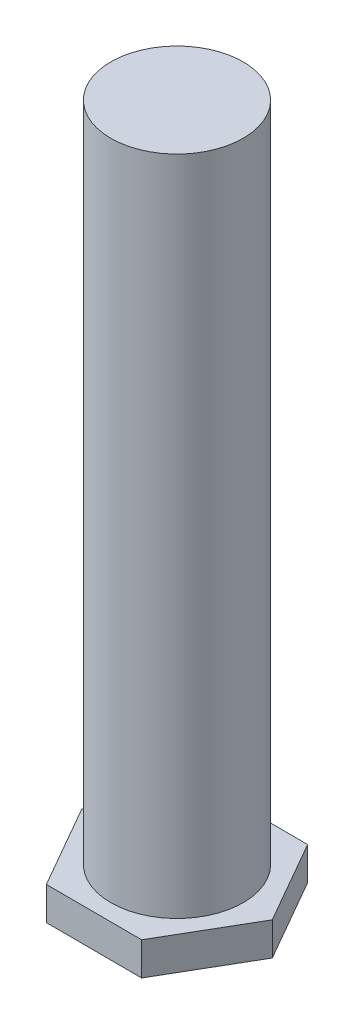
ISO-10303-21;
HEADER;
FILE_DESCRIPTION(('STEP AP214'),'2;1');
FILE_NAME('part.step','',(''),(''),'','','');
FILE_SCHEMA(('AUTOMOTIVE_DESIGN { 1 0 10303 214 1 1 1 1 }'));
ENDSEC;
DATA;
#1=APPLICATION_CONTEXT('core data for automotive mechanical design processes');
#2=APPLICATION_PROTOCOL_DEFINITION('international standard','automotive_design',2000,#1);
#3=PRODUCT_CONTEXT('',#1,'mechanical');
#4=PRODUCT('Part','Part','',(#3));
#5=PRODUCT_RELATED_PRODUCT_CATEGORY('part','',(#4));
#6=PRODUCT_DEFINITION_FORMATION('','',#4);
#7=PRODUCT_DEFINITION_CONTEXT('part definition',#1,'design');
#8=PRODUCT_DEFINITION('design','',#6,#7);
#9=PRODUCT_DEFINITION_SHAPE('','',#8);
#10=(LENGTH_UNIT() NAMED_UNIT(*) SI_UNIT(.MILLI.,.METRE.));
#11=(NAMED_UNIT(*) PLANE_ANGLE_UNIT() SI_UNIT($,.RADIAN.));
#12=(NAMED_UNIT(*) SI_UNIT($,.STERADIAN.) SOLID_ANGLE_UNIT());
#13=UNCERTAINTY_MEASURE_WITH_UNIT(LENGTH_MEASURE(1.E-05),#10,'distance_accuracy_value','');
#14=(GEOMETRIC_REPRESENTATION_CONTEXT(3) GLOBAL_UNCERTAINTY_ASSIGNED_CONTEXT((#13)) GLOBAL_UNIT_ASSIGNED_CONTEXT((#10,
#11,#12)) REPRESENTATION_CONTEXT('',''));
#15=CARTESIAN_POINT('',(0.,0.,0.));
#16=DIRECTION('',(0.,0.,1.));
#17=DIRECTION('',(1.,0.,0.));
#18=AXIS2_PLACEMENT_3D('',#15,#16,#17);
#19=CARTESIAN_POINT('',(-2.90214691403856,2.,4.99107970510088));
#20=DIRECTION('',(0.00308185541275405,0.,-0.999995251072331));
#21=DIRECTION('',(-0.999995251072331,0.,-0.00308185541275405));
#22=AXIS2_PLACEMENT_3D('',#19,#20,#21);
#23=PLANE('',#22);
#24=DIRECTION('',(0.999995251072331,0.,0.00308185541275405));
#25=VECTOR('',#24,1.);
#26=CARTESIAN_POINT('',(-2.90214691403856,0.,4.99107970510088));
#27=LINE('',#26,#25);
#28=CARTESIAN_POINT('',(-2.90214691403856,0.,4.99107970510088));
#29=VERTEX_POINT('',#28);
#30=CARTESIAN_POINT('',(2.87132835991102,0.,5.00887280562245));
#31=VERTEX_POINT('',#30);
#32=EDGE_CURVE('E119',#29,#31,#27,.T.);
#33=ORIENTED_EDGE('',*,*,#32,.T.);
#34=DIRECTION('',(0.,-1.,0.));
#35=VECTOR('',#34,1.);
#36=CARTESIAN_POINT('',(2.87132835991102,2.,5.00887280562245));
#37=LINE('',#36,#35);
#38=CARTESIAN_POINT('',(2.87132835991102,2.,5.00887280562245));
#39=VERTEX_POINT('',#38);
#40=EDGE_CURVE('E36',#39,#31,#37,.T.);
#41=ORIENTED_EDGE('',*,*,#40,.F.);
#42=DIRECTION('',(0.999995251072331,0.,0.00308185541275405));
#43=VECTOR('',#42,1.);
#44=CARTESIAN_POINT('',(-2.90214691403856,2.,4.99107970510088));
#45=LINE('',#44,#43);
#46=CARTESIAN_POINT('',(-2.90214691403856,2.,4.99107970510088));
#47=VERTEX_POINT('',#46);
#48=EDGE_CURVE('E130',#47,#39,#45,.T.);
#49=ORIENTED_EDGE('',*,*,#48,.F.);
#50=DIRECTION('',(0.,-1.,0.));
#51=VECTOR('',#50,1.);
#52=CARTESIAN_POINT('',(-2.90214691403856,2.,4.99107970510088));
#53=LINE('',#52,#51);
#54=EDGE_CURVE('E115',#47,#29,#53,.T.);
#55=ORIENTED_EDGE('',*,*,#54,.T.);
#56=EDGE_LOOP('',(#33,#41,#49,#55));
#57=FACE_BOUND('',#56,.T.);
#58=ADVANCED_FACE('F33',(#57),#23,.F.);
#59=CARTESIAN_POINT('',(2.87132835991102,2.,5.00887280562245));
#60=DIRECTION('',(-0.86448036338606,0.,-0.502666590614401));
#61=DIRECTION('',(-0.502666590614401,0.,0.86448036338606));
#62=AXIS2_PLACEMENT_3D('',#59,#60,#61);
#63=PLANE('',#62);
#64=DIRECTION('',(0.502666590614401,0.,-0.86448036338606));
#65=VECTOR('',#64,1.);
#66=CARTESIAN_POINT('',(2.87132835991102,0.,5.00887280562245));
#67=LINE('',#66,#65);
#68=CARTESIAN_POINT('',(5.77347527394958,0.,0.0177931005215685));
#69=VERTEX_POINT('',#68);
#70=EDGE_CURVE('E122',#31,#69,#67,.T.);
#71=ORIENTED_EDGE('',*,*,#70,.T.);
#72=DIRECTION('',(0.,-1.,0.));
#73=VECTOR('',#72,1.);
#74=CARTESIAN_POINT('',(5.77347527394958,2.,0.0177931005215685));
#75=LINE('',#74,#73);
#76=CARTESIAN_POINT('',(5.77347527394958,2.,0.0177931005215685));
#77=VERTEX_POINT('',#76);
#78=EDGE_CURVE('E133',#77,#69,#75,.T.);
#79=ORIENTED_EDGE('',*,*,#78,.F.);
#80=DIRECTION('',(0.502666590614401,0.,-0.86448036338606));
#81=VECTOR('',#80,1.);
#82=CARTESIAN_POINT('',(2.87132835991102,2.,5.00887280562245));
#83=LINE('',#82,#81);
#84=EDGE_CURVE('E88',#39,#77,#83,.T.);
#85=ORIENTED_EDGE('',*,*,#84,.F.);
#86=ORIENTED_EDGE('',*,*,#40,.T.);
#87=EDGE_LOOP('',(#71,#79,#85,#86));
#88=FACE_BOUND('',#87,.T.);
#89=ADVANCED_FACE('F138',(#88),#63,.F.);
#90=CARTESIAN_POINT('',(5.77347527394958,2.,0.0177931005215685));
#91=DIRECTION('',(-0.867562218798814,0.,0.49732866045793));
#92=DIRECTION('',(0.49732866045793,0.,0.867562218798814));
#93=AXIS2_PLACEMENT_3D('',#90,#91,#92);
#94=PLANE('',#93);
#95=DIRECTION('',(-0.49732866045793,0.,-0.867562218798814));
#96=VECTOR('',#95,1.);
#97=CARTESIAN_POINT('',(5.77347527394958,0.,0.0177931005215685));
#98=LINE('',#97,#96);
#99=CARTESIAN_POINT('',(2.90214691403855,0.,-4.9910797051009));
#100=VERTEX_POINT('',#99);
#101=EDGE_CURVE('E125',#69,#100,#98,.T.);
#102=ORIENTED_EDGE('',*,*,#101,.T.);
#103=DIRECTION('',(0.,-1.,0.));
#104=VECTOR('',#103,1.);
#105=CARTESIAN_POINT('',(2.90214691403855,2.,-4.9910797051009));
#106=LINE('',#105,#104);
#107=CARTESIAN_POINT('',(2.90214691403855,2.,-4.9910797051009));
#108=VERTEX_POINT('',#107);
#109=EDGE_CURVE('E110',#108,#100,#106,.T.);
#110=ORIENTED_EDGE('',*,*,#109,.F.);
#111=DIRECTION('',(-0.49732866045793,0.,-0.867562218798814));
#112=VECTOR('',#111,1.);
#113=CARTESIAN_POINT('',(5.77347527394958,2.,0.0177931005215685));
#114=LINE('',#113,#112);
#115=EDGE_CURVE('E101',#77,#108,#114,.T.);
#116=ORIENTED_EDGE('',*,*,#115,.F.);
#117=ORIENTED_EDGE('',*,*,#78,.T.);
#118=EDGE_LOOP('',(#102,#110,#116,#117));
#119=FACE_BOUND('',#118,.T.);
#120=ADVANCED_FACE('F144',(#119),#94,.F.);
#121=CARTESIAN_POINT('',(2.90214691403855,2.,-4.9910797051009));
#122=DIRECTION('',(-0.00308185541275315,0.,0.999995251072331));
#123=DIRECTION('',(0.999995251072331,0.,0.00308185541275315));
#124=AXIS2_PLACEMENT_3D('',#121,#122,#123);
#125=PLANE('',#124);
#126=DIRECTION('',(-0.999995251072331,0.,-0.00308185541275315));
#127=VECTOR('',#126,1.);
#128=CARTESIAN_POINT('',(2.90214691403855,0.,-4.9910797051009));
#129=LINE('',#128,#127);
#130=CARTESIAN_POINT('',(-2.87132835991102,0.,-5.00887280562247));
#131=VERTEX_POINT('',#130);
#132=EDGE_CURVE('E109',#100,#131,#129,.T.);
#133=ORIENTED_EDGE('',*,*,#132,.T.);
#134=DIRECTION('',(0.,-1.,0.));
#135=VECTOR('',#134,1.);
#136=CARTESIAN_POINT('',(-2.87132835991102,2.,-5.00887280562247));
#137=LINE('',#136,#135);
#138=CARTESIAN_POINT('',(-2.87132835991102,2.,-5.00887280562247));
#139=VERTEX_POINT('',#138);
#140=EDGE_CURVE('E106',#139,#131,#137,.T.);
#141=ORIENTED_EDGE('',*,*,#140,.F.);
#142=DIRECTION('',(-0.999995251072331,0.,-0.00308185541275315));
#143=VECTOR('',#142,1.);
#144=CARTESIAN_POINT('',(2.90214691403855,2.,-4.9910797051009));
#145=LINE('',#144,#143);
#146=EDGE_CURVE('E95',#108,#139,#145,.T.);
#147=ORIENTED_EDGE('',*,*,#146,.F.);
#148=ORIENTED_EDGE('',*,*,#109,.T.);
#149=EDGE_LOOP('',(#133,#141,#147,#148));
#150=FACE_BOUND('',#149,.T.);
#151=ADVANCED_FACE('F107',(#150),#125,.F.);
#152=CARTESIAN_POINT('',(-2.87132835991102,2.,-5.00887280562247));
#153=DIRECTION('',(0.864480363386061,0.,0.502666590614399));
#154=DIRECTION('',(0.502666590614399,0.,-0.864480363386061));
#155=AXIS2_PLACEMENT_3D('',#152,#153,#154);
#156=PLANE('',#155);
#157=DIRECTION('',(-0.502666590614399,0.,0.864480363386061));
#158=VECTOR('',#157,1.);
#159=CARTESIAN_POINT('',(-2.87132835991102,0.,-5.00887280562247));
#160=LINE('',#159,#158);
#161=CARTESIAN_POINT('',(-5.77347527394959,0.,-0.0177931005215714));
#162=VERTEX_POINT('',#161);
#163=EDGE_CURVE('E73',#131,#162,#160,.T.);
#164=ORIENTED_EDGE('',*,*,#163,.T.);
#165=DIRECTION('',(0.,-1.,0.));
#166=VECTOR('',#165,1.);
#167=CARTESIAN_POINT('',(-5.77347527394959,2.,-0.0177931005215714));
#168=LINE('',#167,#166);
#169=CARTESIAN_POINT('',(-5.77347527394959,2.,-0.0177931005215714));
#170=VERTEX_POINT('',#169);
#171=EDGE_CURVE('E111',#170,#162,#168,.T.);
#172=ORIENTED_EDGE('',*,*,#171,.F.);
#173=DIRECTION('',(-0.502666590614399,0.,0.864480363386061));
#174=VECTOR('',#173,1.);
#175=CARTESIAN_POINT('',(-2.87132835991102,2.,-5.00887280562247));
#176=LINE('',#175,#174);
#177=EDGE_CURVE('E99',#139,#170,#176,.T.);
#178=ORIENTED_EDGE('',*,*,#177,.F.);
#179=ORIENTED_EDGE('',*,*,#140,.T.);
#180=EDGE_LOOP('',(#164,#172,#178,#179));
#181=FACE_BOUND('',#180,.T.);
#182=ADVANCED_FACE('F113',(#181),#156,.F.);
#183=CARTESIAN_POINT('',(-5.77347527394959,2.,-0.0177931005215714));
#184=DIRECTION('',(0.867562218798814,0.,-0.49732866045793));
#185=DIRECTION('',(-0.49732866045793,0.,-0.867562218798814));
#186=AXIS2_PLACEMENT_3D('',#183,#184,#185);
#187=PLANE('',#186);
#188=DIRECTION('',(0.49732866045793,0.,0.867562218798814));
#189=VECTOR('',#188,1.);
#190=CARTESIAN_POINT('',(-5.77347527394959,0.,-0.0177931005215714));
#191=LINE('',#190,#189);
#192=EDGE_CURVE('E79',#162,#29,#191,.T.);
#193=ORIENTED_EDGE('',*,*,#192,.T.);
#194=ORIENTED_EDGE('',*,*,#54,.F.);
#195=DIRECTION('',(0.49732866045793,0.,0.867562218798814));
#196=VECTOR('',#195,1.);
#197=CARTESIAN_POINT('',(-5.77347527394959,2.,-0.0177931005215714));
#198=LINE('',#197,#196);
#199=EDGE_CURVE('E50',#170,#47,#198,.T.);
#200=ORIENTED_EDGE('',*,*,#199,.F.);
#201=ORIENTED_EDGE('',*,*,#171,.T.);
#202=EDGE_LOOP('',(#193,#194,#200,#201));
#203=FACE_BOUND('',#202,.T.);
#204=ADVANCED_FACE('F160',(#203),#187,.F.);
#205=CARTESIAN_POINT('',(0.,2.,0.));
#206=DIRECTION('',(0.,1.,0.));
#207=DIRECTION('',(0.,0.,1.));
#208=AXIS2_PLACEMENT_3D('',#205,#206,#207);
#209=PLANE('',#208);
#210=CARTESIAN_POINT('',(0.,2.,0.));
#211=DIRECTION('',(0.,1.,0.));
#212=DIRECTION('',(0.,0.,1.));
#213=AXIS2_PLACEMENT_3D('',#210,#211,#212);
#214=CIRCLE('',#213,4.);
#215=CARTESIAN_POINT('',(0.,2.,4.));
#216=VERTEX_POINT('',#215);
#217=EDGE_CURVE('E11',#216,#216,#214,.T.);
#218=ORIENTED_EDGE('',*,*,#217,.F.);
#219=EDGE_LOOP('',(#218));
#220=FACE_BOUND('',#219,.T.);
#221=ORIENTED_EDGE('',*,*,#48,.T.);
#222=ORIENTED_EDGE('',*,*,#84,.T.);
#223=ORIENTED_EDGE('',*,*,#115,.T.);
#224=ORIENTED_EDGE('',*,*,#146,.T.);
#225=ORIENTED_EDGE('',*,*,#177,.T.);
#226=ORIENTED_EDGE('',*,*,#199,.T.);
#227=EDGE_LOOP('',(#221,#222,#223,#224,#225,#226));
#228=FACE_BOUND('',#227,.T.);
#229=ADVANCED_FACE('F97',(#220,#228),#209,.T.);
#230=CARTESIAN_POINT('',(0.,0.,0.));
#231=DIRECTION('',(0.,1.,0.));
#232=DIRECTION('',(0.,0.,1.));
#233=AXIS2_PLACEMENT_3D('',#230,#231,#232);
#234=PLANE('',#233);
#235=ORIENTED_EDGE('',*,*,#32,.F.);
#236=ORIENTED_EDGE('',*,*,#192,.F.);
#237=ORIENTED_EDGE('',*,*,#163,.F.);
#238=ORIENTED_EDGE('',*,*,#132,.F.);
#239=ORIENTED_EDGE('',*,*,#101,.F.);
#240=ORIENTED_EDGE('',*,*,#70,.F.);
#241=EDGE_LOOP('',(#235,#236,#237,#238,#239,#240));
#242=FACE_BOUND('',#241,.T.);
#243=ADVANCED_FACE('F143',(#242),#234,.F.);
#244=CARTESIAN_POINT('',(0.,42.,0.));
#245=DIRECTION('',(0.,-1.,0.));
#246=DIRECTION('',(0.,0.,-1.));
#247=AXIS2_PLACEMENT_3D('',#244,#245,#246);
#248=CYLINDRICAL_SURFACE('',#247,4.);
#249=CARTESIAN_POINT('',(0.,42.,0.));
#250=DIRECTION('',(0.,1.,0.));
#251=DIRECTION('',(0.,0.,1.));
#252=AXIS2_PLACEMENT_3D('',#249,#250,#251);
#253=CIRCLE('',#252,4.);
#254=CARTESIAN_POINT('',(0.,42.,4.));
#255=VERTEX_POINT('',#254);
#256=EDGE_CURVE('E123',#255,#255,#253,.T.);
#257=ORIENTED_EDGE('',*,*,#256,.F.);
#258=EDGE_LOOP('',(#257));
#259=FACE_BOUND('',#258,.T.);
#260=ORIENTED_EDGE('',*,*,#217,.T.);
#261=EDGE_LOOP('',(#260));
#262=FACE_BOUND('',#261,.T.);
#263=ADVANCED_FACE('F153',(#259,#262),#248,.T.);
#264=CARTESIAN_POINT('',(0.,42.,0.));
#265=DIRECTION('',(0.,1.,0.));
#266=DIRECTION('',(0.,0.,1.));
#267=AXIS2_PLACEMENT_3D('',#264,#265,#266);
#268=PLANE('',#267);
#269=ORIENTED_EDGE('',*,*,#256,.T.);
#270=EDGE_LOOP('',(#269));
#271=FACE_BOUND('',#270,.T.);
#272=ADVANCED_FACE('F151',(#271),#268,.T.);
#273=CLOSED_SHELL('',(#58,#89,#120,#151,#182,#204,#229,#243,#263,#272));
#274=MANIFOLD_SOLID_BREP('B2',#273);
#275=ADVANCED_BREP_SHAPE_REPRESENTATION('',(#18,#274),#14);
#276=SHAPE_DEFINITION_REPRESENTATION(#9,#275);
ENDSEC;
END-ISO-10303-21;
